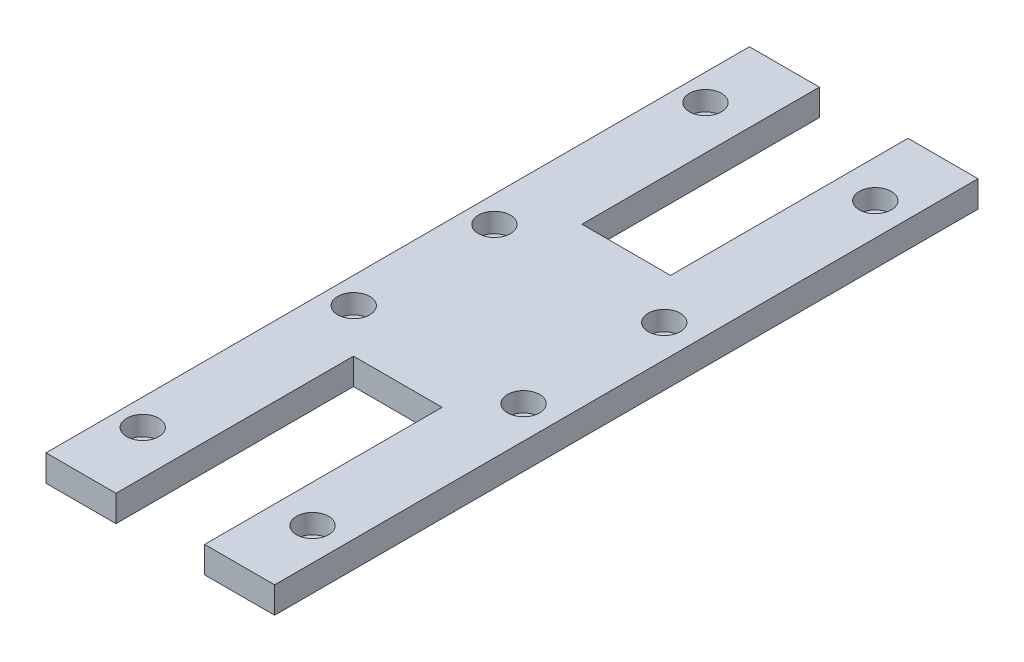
ISO-10303-21;
HEADER;
FILE_DESCRIPTION(('STEP AP214'),'2;1');
FILE_NAME('part.step','',(''),(''),'','','');
FILE_SCHEMA(('AUTOMOTIVE_DESIGN { 1 0 10303 214 1 1 1 1 }'));
ENDSEC;
DATA;
#1=APPLICATION_CONTEXT('core data for automotive mechanical design processes');
#2=APPLICATION_PROTOCOL_DEFINITION('international standard','automotive_design',2000,#1);
#3=PRODUCT_CONTEXT('',#1,'mechanical');
#4=PRODUCT('Part','Part','',(#3));
#5=PRODUCT_RELATED_PRODUCT_CATEGORY('part','',(#4));
#6=PRODUCT_DEFINITION_FORMATION('','',#4);
#7=PRODUCT_DEFINITION_CONTEXT('part definition',#1,'design');
#8=PRODUCT_DEFINITION('design','',#6,#7);
#9=PRODUCT_DEFINITION_SHAPE('','',#8);
#10=(LENGTH_UNIT() NAMED_UNIT(*) SI_UNIT(.MILLI.,.METRE.));
#11=(NAMED_UNIT(*) PLANE_ANGLE_UNIT() SI_UNIT($,.RADIAN.));
#12=(NAMED_UNIT(*) SI_UNIT($,.STERADIAN.) SOLID_ANGLE_UNIT());
#13=UNCERTAINTY_MEASURE_WITH_UNIT(LENGTH_MEASURE(1.E-05),#10,'distance_accuracy_value','');
#14=(GEOMETRIC_REPRESENTATION_CONTEXT(3) GLOBAL_UNCERTAINTY_ASSIGNED_CONTEXT((#13)) GLOBAL_UNIT_ASSIGNED_CONTEXT((#10,
#11,#12)) REPRESENTATION_CONTEXT('',''));
#15=CARTESIAN_POINT('',(0.,0.,0.));
#16=DIRECTION('',(0.,0.,1.));
#17=DIRECTION('',(1.,0.,0.));
#18=AXIS2_PLACEMENT_3D('',#15,#16,#17);
#19=CARTESIAN_POINT('',(35.4285027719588,-1.5875,-12.7));
#20=DIRECTION('',(0.,1.,0.));
#21=DIRECTION('',(0.,0.,1.));
#22=AXIS2_PLACEMENT_3D('',#19,#20,#21);
#23=CYLINDRICAL_SURFACE('',#22,1.778);
#24=CARTESIAN_POINT('',(35.4285027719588,0.,-12.7));
#25=DIRECTION('',(0.,-1.,0.));
#26=DIRECTION('',(0.,0.,-1.));
#27=AXIS2_PLACEMENT_3D('',#24,#25,#26);
#28=CIRCLE('',#27,1.778);
#29=CARTESIAN_POINT('',(35.4285027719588,0.,-14.478));
#30=VERTEX_POINT('',#29);
#31=EDGE_CURVE('E178',#30,#30,#28,.T.);
#32=ORIENTED_EDGE('',*,*,#31,.T.);
#33=EDGE_LOOP('',(#32));
#34=FACE_BOUND('',#33,.T.);
#35=CARTESIAN_POINT('',(35.4285027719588,1.2573,-12.7));
#36=DIRECTION('',(0.,1.,0.));
#37=DIRECTION('',(0.,0.,1.));
#38=AXIS2_PLACEMENT_3D('',#35,#36,#37);
#39=CIRCLE('',#38,1.778);
#40=CARTESIAN_POINT('',(35.4285027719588,1.2573,-10.922));
#41=VERTEX_POINT('',#40);
#42=EDGE_CURVE('E37',#41,#41,#39,.F.);
#43=ORIENTED_EDGE('',*,*,#42,.F.);
#44=EDGE_LOOP('',(#43));
#45=FACE_BOUND('',#44,.T.);
#46=ADVANCED_FACE('F33',(#34,#45),#23,.F.);
#47=CARTESIAN_POINT('',(35.4285027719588,-1.5875,-50.8));
#48=DIRECTION('',(0.,1.,0.));
#49=DIRECTION('',(0.,0.,1.));
#50=AXIS2_PLACEMENT_3D('',#47,#48,#49);
#51=CYLINDRICAL_SURFACE('',#50,1.778);
#52=CARTESIAN_POINT('',(35.4285027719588,0.,-50.8));
#53=DIRECTION('',(0.,-1.,0.));
#54=DIRECTION('',(0.,0.,-1.));
#55=AXIS2_PLACEMENT_3D('',#52,#53,#54);
#56=CIRCLE('',#55,1.778);
#57=CARTESIAN_POINT('',(35.4285027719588,0.,-52.578));
#58=VERTEX_POINT('',#57);
#59=EDGE_CURVE('E181',#58,#58,#56,.T.);
#60=ORIENTED_EDGE('',*,*,#59,.T.);
#61=EDGE_LOOP('',(#60));
#62=FACE_BOUND('',#61,.T.);
#63=CARTESIAN_POINT('',(35.4285027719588,1.2573,-50.8));
#64=DIRECTION('',(0.,1.,0.));
#65=DIRECTION('',(0.,0.,1.));
#66=AXIS2_PLACEMENT_3D('',#63,#64,#65);
#67=CIRCLE('',#66,1.778);
#68=CARTESIAN_POINT('',(35.4285027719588,1.2573,-49.022));
#69=VERTEX_POINT('',#68);
#70=EDGE_CURVE('E217',#69,#69,#67,.F.);
#71=ORIENTED_EDGE('',*,*,#70,.F.);
#72=EDGE_LOOP('',(#71));
#73=FACE_BOUND('',#72,.T.);
#74=ADVANCED_FACE('F303',(#62,#73),#51,.F.);
#75=CARTESIAN_POINT('',(35.4285027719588,-1.5875,-76.2));
#76=DIRECTION('',(0.,1.,0.));
#77=DIRECTION('',(0.,0.,1.));
#78=AXIS2_PLACEMENT_3D('',#75,#76,#77);
#79=CYLINDRICAL_SURFACE('',#78,1.778);
#80=CARTESIAN_POINT('',(35.4285027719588,0.,-76.2));
#81=DIRECTION('',(0.,-1.,0.));
#82=DIRECTION('',(0.,0.,-1.));
#83=AXIS2_PLACEMENT_3D('',#80,#81,#82);
#84=CIRCLE('',#83,1.778);
#85=CARTESIAN_POINT('',(35.4285027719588,0.,-77.978));
#86=VERTEX_POINT('',#85);
#87=EDGE_CURVE('E185',#86,#86,#84,.T.);
#88=ORIENTED_EDGE('',*,*,#87,.T.);
#89=EDGE_LOOP('',(#88));
#90=FACE_BOUND('',#89,.T.);
#91=CARTESIAN_POINT('',(35.4285027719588,1.2573,-76.2));
#92=DIRECTION('',(0.,1.,0.));
#93=DIRECTION('',(0.,0.,1.));
#94=AXIS2_PLACEMENT_3D('',#91,#92,#93);
#95=CIRCLE('',#94,1.778);
#96=CARTESIAN_POINT('',(35.4285027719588,1.2573,-74.422));
#97=VERTEX_POINT('',#96);
#98=EDGE_CURVE('E215',#97,#97,#95,.F.);
#99=ORIENTED_EDGE('',*,*,#98,.F.);
#100=EDGE_LOOP('',(#99));
#101=FACE_BOUND('',#100,.T.);
#102=ADVANCED_FACE('F309',(#90,#101),#79,.F.);
#103=CARTESIAN_POINT('',(35.4285027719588,-1.5875,-114.3));
#104=DIRECTION('',(0.,1.,0.));
#105=DIRECTION('',(0.,0.,1.));
#106=AXIS2_PLACEMENT_3D('',#103,#104,#105);
#107=CYLINDRICAL_SURFACE('',#106,1.778);
#108=CARTESIAN_POINT('',(35.4285027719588,0.,-114.3));
#109=DIRECTION('',(0.,-1.,0.));
#110=DIRECTION('',(0.,0.,-1.));
#111=AXIS2_PLACEMENT_3D('',#108,#109,#110);
#112=CIRCLE('',#111,1.778);
#113=CARTESIAN_POINT('',(35.4285027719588,0.,-116.078));
#114=VERTEX_POINT('',#113);
#115=EDGE_CURVE('E188',#114,#114,#112,.T.);
#116=ORIENTED_EDGE('',*,*,#115,.T.);
#117=EDGE_LOOP('',(#116));
#118=FACE_BOUND('',#117,.T.);
#119=CARTESIAN_POINT('',(35.4285027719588,1.2573,-114.3));
#120=DIRECTION('',(0.,1.,0.));
#121=DIRECTION('',(0.,0.,1.));
#122=AXIS2_PLACEMENT_3D('',#119,#120,#121);
#123=CIRCLE('',#122,1.778);
#124=CARTESIAN_POINT('',(35.4285027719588,1.2573,-112.522));
#125=VERTEX_POINT('',#124);
#126=EDGE_CURVE('E212',#125,#125,#123,.F.);
#127=ORIENTED_EDGE('',*,*,#126,.F.);
#128=EDGE_LOOP('',(#127));
#129=FACE_BOUND('',#128,.T.);
#130=ADVANCED_FACE('F351',(#118,#129),#107,.F.);
#131=CARTESIAN_POINT('',(4.7625,-1.5875,-12.7));
#132=DIRECTION('',(0.,1.,0.));
#133=DIRECTION('',(0.,0.,1.));
#134=AXIS2_PLACEMENT_3D('',#131,#132,#133);
#135=CYLINDRICAL_SURFACE('',#134,1.778);
#136=CARTESIAN_POINT('',(4.7625,0.,-12.7));
#137=DIRECTION('',(0.,-1.,0.));
#138=DIRECTION('',(0.,0.,-1.));
#139=AXIS2_PLACEMENT_3D('',#136,#137,#138);
#140=CIRCLE('',#139,1.778);
#141=CARTESIAN_POINT('',(4.7625,0.,-14.478));
#142=VERTEX_POINT('',#141);
#143=EDGE_CURVE('E191',#142,#142,#140,.T.);
#144=ORIENTED_EDGE('',*,*,#143,.T.);
#145=EDGE_LOOP('',(#144));
#146=FACE_BOUND('',#145,.T.);
#147=CARTESIAN_POINT('',(4.7625,1.2573,-12.7));
#148=DIRECTION('',(0.,1.,0.));
#149=DIRECTION('',(0.,0.,1.));
#150=AXIS2_PLACEMENT_3D('',#147,#148,#149);
#151=CIRCLE('',#150,1.778);
#152=CARTESIAN_POINT('',(4.7625,1.2573,-10.922));
#153=VERTEX_POINT('',#152);
#154=EDGE_CURVE('E209',#153,#153,#151,.F.);
#155=ORIENTED_EDGE('',*,*,#154,.F.);
#156=EDGE_LOOP('',(#155));
#157=FACE_BOUND('',#156,.T.);
#158=ADVANCED_FACE('F347',(#146,#157),#135,.F.);
#159=CARTESIAN_POINT('',(4.7625,-1.5875,-50.8));
#160=DIRECTION('',(0.,1.,0.));
#161=DIRECTION('',(0.,0.,1.));
#162=AXIS2_PLACEMENT_3D('',#159,#160,#161);
#163=CYLINDRICAL_SURFACE('',#162,1.778);
#164=CARTESIAN_POINT('',(4.7625,0.,-50.8));
#165=DIRECTION('',(0.,-1.,0.));
#166=DIRECTION('',(0.,0.,-1.));
#167=AXIS2_PLACEMENT_3D('',#164,#165,#166);
#168=CIRCLE('',#167,1.778);
#169=CARTESIAN_POINT('',(4.7625,0.,-52.578));
#170=VERTEX_POINT('',#169);
#171=EDGE_CURVE('E194',#170,#170,#168,.T.);
#172=ORIENTED_EDGE('',*,*,#171,.T.);
#173=EDGE_LOOP('',(#172));
#174=FACE_BOUND('',#173,.T.);
#175=CARTESIAN_POINT('',(4.7625,1.2573,-50.8));
#176=DIRECTION('',(0.,1.,0.));
#177=DIRECTION('',(0.,0.,1.));
#178=AXIS2_PLACEMENT_3D('',#175,#176,#177);
#179=CIRCLE('',#178,1.778);
#180=CARTESIAN_POINT('',(4.7625,1.2573,-49.022));
#181=VERTEX_POINT('',#180);
#182=EDGE_CURVE('E205',#181,#181,#179,.F.);
#183=ORIENTED_EDGE('',*,*,#182,.F.);
#184=EDGE_LOOP('',(#183));
#185=FACE_BOUND('',#184,.T.);
#186=ADVANCED_FACE('F324',(#174,#185),#163,.F.);
#187=CARTESIAN_POINT('',(4.7625,-1.5875,-76.2));
#188=DIRECTION('',(0.,1.,0.));
#189=DIRECTION('',(0.,0.,1.));
#190=AXIS2_PLACEMENT_3D('',#187,#188,#189);
#191=CYLINDRICAL_SURFACE('',#190,1.778);
#192=CARTESIAN_POINT('',(4.7625,0.,-76.2));
#193=DIRECTION('',(0.,-1.,0.));
#194=DIRECTION('',(0.,0.,-1.));
#195=AXIS2_PLACEMENT_3D('',#192,#193,#194);
#196=CIRCLE('',#195,1.778);
#197=CARTESIAN_POINT('',(4.7625,0.,-77.978));
#198=VERTEX_POINT('',#197);
#199=EDGE_CURVE('E177',#198,#198,#196,.T.);
#200=ORIENTED_EDGE('',*,*,#199,.T.);
#201=EDGE_LOOP('',(#200));
#202=FACE_BOUND('',#201,.T.);
#203=CARTESIAN_POINT('',(4.7625,1.2573,-76.2));
#204=DIRECTION('',(0.,1.,0.));
#205=DIRECTION('',(0.,0.,1.));
#206=AXIS2_PLACEMENT_3D('',#203,#204,#205);
#207=CIRCLE('',#206,1.778);
#208=CARTESIAN_POINT('',(4.7625,1.2573,-74.422));
#209=VERTEX_POINT('',#208);
#210=EDGE_CURVE('E202',#209,#209,#207,.F.);
#211=ORIENTED_EDGE('',*,*,#210,.F.);
#212=EDGE_LOOP('',(#211));
#213=FACE_BOUND('',#212,.T.);
#214=ADVANCED_FACE('F316',(#202,#213),#191,.F.);
#215=CARTESIAN_POINT('',(4.7625,-1.5875,-114.3));
#216=DIRECTION('',(0.,1.,0.));
#217=DIRECTION('',(0.,0.,1.));
#218=AXIS2_PLACEMENT_3D('',#215,#216,#217);
#219=CYLINDRICAL_SURFACE('',#218,1.778);
#220=CARTESIAN_POINT('',(4.7625,0.,-114.3));
#221=DIRECTION('',(0.,-1.,0.));
#222=DIRECTION('',(0.,0.,-1.));
#223=AXIS2_PLACEMENT_3D('',#220,#221,#222);
#224=CIRCLE('',#223,1.778);
#225=CARTESIAN_POINT('',(4.7625,0.,-116.078));
#226=VERTEX_POINT('',#225);
#227=EDGE_CURVE('E134',#226,#226,#224,.T.);
#228=ORIENTED_EDGE('',*,*,#227,.T.);
#229=EDGE_LOOP('',(#228));
#230=FACE_BOUND('',#229,.T.);
#231=CARTESIAN_POINT('',(4.7625,1.2573,-114.3));
#232=DIRECTION('',(0.,1.,0.));
#233=DIRECTION('',(0.,0.,1.));
#234=AXIS2_PLACEMENT_3D('',#231,#232,#233);
#235=CIRCLE('',#234,1.778);
#236=CARTESIAN_POINT('',(4.7625,1.2573,-112.522));
#237=VERTEX_POINT('',#236);
#238=EDGE_CURVE('E182',#237,#237,#235,.F.);
#239=ORIENTED_EDGE('',*,*,#238,.F.);
#240=EDGE_LOOP('',(#239));
#241=FACE_BOUND('',#240,.T.);
#242=ADVANCED_FACE('F314',(#230,#241),#219,.F.);
#243=CARTESIAN_POINT('',(0.,0.,0.));
#244=DIRECTION('',(0.,0.,-1.));
#245=DIRECTION('',(-1.,0.,0.));
#246=AXIS2_PLACEMENT_3D('',#243,#244,#245);
#247=PLANE('',#246);
#248=DIRECTION('',(1.,0.,0.));
#249=VECTOR('',#248,1.);
#250=CARTESIAN_POINT('',(0.,0.,0.));
#251=LINE('',#250,#249);
#252=CARTESIAN_POINT('',(0.,0.,0.));
#253=VERTEX_POINT('',#252);
#254=CARTESIAN_POINT('',(12.6365,0.,0.));
#255=VERTEX_POINT('',#254);
#256=EDGE_CURVE('E143',#253,#255,#251,.T.);
#257=ORIENTED_EDGE('',*,*,#256,.T.);
#258=DIRECTION('',(0.,1.,0.));
#259=VECTOR('',#258,1.);
#260=CARTESIAN_POINT('',(12.6365,0.,0.));
#261=LINE('',#260,#259);
#262=CARTESIAN_POINT('',(12.6365,4.7625,0.));
#263=VERTEX_POINT('',#262);
#264=EDGE_CURVE('E42',#255,#263,#261,.T.);
#265=ORIENTED_EDGE('',*,*,#264,.T.);
#266=DIRECTION('',(-1.,0.,0.));
#267=VECTOR('',#266,1.);
#268=CARTESIAN_POINT('',(0.,4.7625,0.));
#269=LINE('',#268,#267);
#270=CARTESIAN_POINT('',(0.,4.7625,0.));
#271=VERTEX_POINT('',#270);
#272=EDGE_CURVE('E140',#263,#271,#269,.T.);
#273=ORIENTED_EDGE('',*,*,#272,.T.);
#274=DIRECTION('',(0.,-1.,0.));
#275=VECTOR('',#274,1.);
#276=CARTESIAN_POINT('',(0.,0.,0.));
#277=LINE('',#276,#275);
#278=EDGE_CURVE('E258',#271,#253,#277,.T.);
#279=ORIENTED_EDGE('',*,*,#278,.T.);
#280=EDGE_LOOP('',(#257,#265,#273,#279));
#281=FACE_BOUND('',#280,.T.);
#282=ADVANCED_FACE('F138',(#281),#247,.F.);
#283=CARTESIAN_POINT('',(0.,0.,-127.));
#284=DIRECTION('',(0.,0.,-1.));
#285=DIRECTION('',(-1.,0.,0.));
#286=AXIS2_PLACEMENT_3D('',#283,#284,#285);
#287=PLANE('',#286);
#288=DIRECTION('',(0.,1.,0.));
#289=VECTOR('',#288,1.);
#290=CARTESIAN_POINT('',(12.6365,0.,-127.));
#291=LINE('',#290,#289);
#292=CARTESIAN_POINT('',(12.6365,0.,-127.));
#293=VERTEX_POINT('',#292);
#294=CARTESIAN_POINT('',(12.6365,4.7625,-127.));
#295=VERTEX_POINT('',#294);
#296=EDGE_CURVE('E170',#293,#295,#291,.T.);
#297=ORIENTED_EDGE('',*,*,#296,.F.);
#298=DIRECTION('',(1.,0.,0.));
#299=VECTOR('',#298,1.);
#300=CARTESIAN_POINT('',(0.,0.,-127.));
#301=LINE('',#300,#299);
#302=CARTESIAN_POINT('',(0.,0.,-127.));
#303=VERTEX_POINT('',#302);
#304=EDGE_CURVE('E262',#303,#293,#301,.T.);
#305=ORIENTED_EDGE('',*,*,#304,.F.);
#306=DIRECTION('',(0.,-1.,0.));
#307=VECTOR('',#306,1.);
#308=CARTESIAN_POINT('',(0.,0.,-127.));
#309=LINE('',#308,#307);
#310=CARTESIAN_POINT('',(0.,4.7625,-127.));
#311=VERTEX_POINT('',#310);
#312=EDGE_CURVE('E154',#311,#303,#309,.T.);
#313=ORIENTED_EDGE('',*,*,#312,.F.);
#314=DIRECTION('',(-1.,0.,0.));
#315=VECTOR('',#314,1.);
#316=CARTESIAN_POINT('',(0.,4.7625,-127.));
#317=LINE('',#316,#315);
#318=EDGE_CURVE('E268',#295,#311,#317,.T.);
#319=ORIENTED_EDGE('',*,*,#318,.F.);
#320=EDGE_LOOP('',(#297,#305,#313,#319));
#321=FACE_BOUND('',#320,.T.);
#322=ADVANCED_FACE('F322',(#321),#287,.T.);
#323=CARTESIAN_POINT('',(0.,0.,-127.));
#324=DIRECTION('',(-1.,0.,0.));
#325=DIRECTION('',(0.,0.,1.));
#326=AXIS2_PLACEMENT_3D('',#323,#324,#325);
#327=PLANE('',#326);
#328=ORIENTED_EDGE('',*,*,#278,.F.);
#329=DIRECTION('',(0.,0.,1.));
#330=VECTOR('',#329,1.);
#331=CARTESIAN_POINT('',(0.,4.7625,-127.));
#332=LINE('',#331,#330);
#333=EDGE_CURVE('E148',#311,#271,#332,.T.);
#334=ORIENTED_EDGE('',*,*,#333,.F.);
#335=ORIENTED_EDGE('',*,*,#312,.T.);
#336=DIRECTION('',(0.,0.,1.));
#337=VECTOR('',#336,1.);
#338=CARTESIAN_POINT('',(0.,0.,-127.));
#339=LINE('',#338,#337);
#340=EDGE_CURVE('E166',#303,#253,#339,.T.);
#341=ORIENTED_EDGE('',*,*,#340,.T.);
#342=EDGE_LOOP('',(#328,#334,#335,#341));
#343=FACE_BOUND('',#342,.T.);
#344=ADVANCED_FACE('F35',(#343),#327,.T.);
#345=CARTESIAN_POINT('',(0.,4.7625,-127.));
#346=DIRECTION('',(0.,1.,0.));
#347=DIRECTION('',(0.,0.,1.));
#348=AXIS2_PLACEMENT_3D('',#345,#346,#347);
#349=PLANE('',#348);
#350=CARTESIAN_POINT('',(4.7625,4.7625,-76.2));
#351=DIRECTION('',(0.,1.,0.));
#352=DIRECTION('',(0.,0.,1.));
#353=AXIS2_PLACEMENT_3D('',#350,#351,#352);
#354=CIRCLE('',#353,2.8956);
#355=CARTESIAN_POINT('',(4.7625,4.7625,-73.3044));
#356=VERTEX_POINT('',#355);
#357=EDGE_CURVE('E429',#356,#356,#354,.T.);
#358=ORIENTED_EDGE('',*,*,#357,.F.);
#359=EDGE_LOOP('',(#358));
#360=FACE_BOUND('',#359,.T.);
#361=CARTESIAN_POINT('',(4.7625,4.7625,-50.8));
#362=DIRECTION('',(0.,1.,0.));
#363=DIRECTION('',(0.,0.,1.));
#364=AXIS2_PLACEMENT_3D('',#361,#362,#363);
#365=CIRCLE('',#364,2.8956);
#366=CARTESIAN_POINT('',(4.7625,4.7625,-47.9044));
#367=VERTEX_POINT('',#366);
#368=EDGE_CURVE('E423',#367,#367,#365,.T.);
#369=ORIENTED_EDGE('',*,*,#368,.F.);
#370=EDGE_LOOP('',(#369));
#371=FACE_BOUND('',#370,.T.);
#372=CARTESIAN_POINT('',(4.7625,4.7625,-12.7));
#373=DIRECTION('',(0.,1.,0.));
#374=DIRECTION('',(0.,0.,1.));
#375=AXIS2_PLACEMENT_3D('',#372,#373,#374);
#376=CIRCLE('',#375,2.8956);
#377=CARTESIAN_POINT('',(4.7625,4.7625,-9.80439999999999));
#378=VERTEX_POINT('',#377);
#379=EDGE_CURVE('E417',#378,#378,#376,.T.);
#380=ORIENTED_EDGE('',*,*,#379,.F.);
#381=EDGE_LOOP('',(#380));
#382=FACE_BOUND('',#381,.T.);
#383=CARTESIAN_POINT('',(35.4285027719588,4.7625,-12.7));
#384=DIRECTION('',(0.,1.,0.));
#385=DIRECTION('',(0.,0.,1.));
#386=AXIS2_PLACEMENT_3D('',#383,#384,#385);
#387=CIRCLE('',#386,2.8956);
#388=CARTESIAN_POINT('',(35.4285027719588,4.7625,-9.80439999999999));
#389=VERTEX_POINT('',#388);
#390=EDGE_CURVE('E411',#389,#389,#387,.T.);
#391=ORIENTED_EDGE('',*,*,#390,.F.);
#392=EDGE_LOOP('',(#391));
#393=FACE_BOUND('',#392,.T.);
#394=CARTESIAN_POINT('',(35.4285027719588,4.7625,-50.8));
#395=DIRECTION('',(0.,1.,0.));
#396=DIRECTION('',(0.,0.,1.));
#397=AXIS2_PLACEMENT_3D('',#394,#395,#396);
#398=CIRCLE('',#397,2.8956);
#399=CARTESIAN_POINT('',(35.4285027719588,4.7625,-47.9044));
#400=VERTEX_POINT('',#399);
#401=EDGE_CURVE('E405',#400,#400,#398,.T.);
#402=ORIENTED_EDGE('',*,*,#401,.F.);
#403=EDGE_LOOP('',(#402));
#404=FACE_BOUND('',#403,.T.);
#405=CARTESIAN_POINT('',(35.4285027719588,4.7625,-76.2));
#406=DIRECTION('',(0.,1.,0.));
#407=DIRECTION('',(0.,0.,1.));
#408=AXIS2_PLACEMENT_3D('',#405,#406,#407);
#409=CIRCLE('',#408,2.8956);
#410=CARTESIAN_POINT('',(35.4285027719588,4.7625,-73.3044));
#411=VERTEX_POINT('',#410);
#412=EDGE_CURVE('E396',#411,#411,#409,.T.);
#413=ORIENTED_EDGE('',*,*,#412,.F.);
#414=EDGE_LOOP('',(#413));
#415=FACE_BOUND('',#414,.T.);
#416=CARTESIAN_POINT('',(35.4285027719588,4.7625,-114.3));
#417=DIRECTION('',(0.,1.,0.));
#418=DIRECTION('',(0.,0.,1.));
#419=AXIS2_PLACEMENT_3D('',#416,#417,#418);
#420=CIRCLE('',#419,2.8956);
#421=CARTESIAN_POINT('',(35.4285027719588,4.7625,-111.4044));
#422=VERTEX_POINT('',#421);
#423=EDGE_CURVE('E397',#422,#422,#420,.T.);
#424=ORIENTED_EDGE('',*,*,#423,.F.);
#425=EDGE_LOOP('',(#424));
#426=FACE_BOUND('',#425,.T.);
#427=CARTESIAN_POINT('',(4.7625,4.7625,-114.3));
#428=DIRECTION('',(0.,1.,0.));
#429=DIRECTION('',(0.,0.,1.));
#430=AXIS2_PLACEMENT_3D('',#427,#428,#429);
#431=CIRCLE('',#430,2.8956);
#432=CARTESIAN_POINT('',(4.7625,4.7625,-111.4044));
#433=VERTEX_POINT('',#432);
#434=EDGE_CURVE('E222',#433,#433,#431,.T.);
#435=ORIENTED_EDGE('',*,*,#434,.F.);
#436=EDGE_LOOP('',(#435));
#437=FACE_BOUND('',#436,.T.);
#438=DIRECTION('',(0.,0.,1.));
#439=VECTOR('',#438,1.);
#440=CARTESIAN_POINT('',(12.6365,4.7625,0.));
#441=LINE('',#440,#439);
#442=CARTESIAN_POINT('',(12.6365,4.7625,-42.8752));
#443=VERTEX_POINT('',#442);
#444=EDGE_CURVE('E123',#443,#263,#441,.T.);
#445=ORIENTED_EDGE('',*,*,#444,.F.);
#446=DIRECTION('',(-1.,0.,0.));
#447=VECTOR('',#446,1.);
#448=CARTESIAN_POINT('',(12.6365,4.7625,-42.8752));
#449=LINE('',#448,#447);
#450=CARTESIAN_POINT('',(28.6385,4.7625,-42.8752));
#451=VERTEX_POINT('',#450);
#452=EDGE_CURVE('E235',#451,#443,#449,.T.);
#453=ORIENTED_EDGE('',*,*,#452,.F.);
#454=DIRECTION('',(0.,0.,-1.));
#455=VECTOR('',#454,1.);
#456=CARTESIAN_POINT('',(28.6385,4.7625,0.));
#457=LINE('',#456,#455);
#458=CARTESIAN_POINT('',(28.6385,4.7625,0.));
#459=VERTEX_POINT('',#458);
#460=EDGE_CURVE('E133',#459,#451,#457,.T.);
#461=ORIENTED_EDGE('',*,*,#460,.F.);
#462=CARTESIAN_POINT('',(41.275,4.7625,0.));
#463=VERTEX_POINT('',#462);
#464=EDGE_CURVE('E150',#463,#459,#269,.T.);
#465=ORIENTED_EDGE('',*,*,#464,.F.);
#466=DIRECTION('',(0.,0.,1.));
#467=VECTOR('',#466,1.);
#468=CARTESIAN_POINT('',(41.275,4.7625,-127.));
#469=LINE('',#468,#467);
#470=CARTESIAN_POINT('',(41.275,4.7625,-127.));
#471=VERTEX_POINT('',#470);
#472=EDGE_CURVE('E161',#471,#463,#469,.T.);
#473=ORIENTED_EDGE('',*,*,#472,.F.);
#474=CARTESIAN_POINT('',(28.6385,4.7625,-127.));
#475=VERTEX_POINT('',#474);
#476=EDGE_CURVE('E168',#471,#475,#317,.T.);
#477=ORIENTED_EDGE('',*,*,#476,.T.);
#478=DIRECTION('',(0.,0.,-1.));
#479=VECTOR('',#478,1.);
#480=CARTESIAN_POINT('',(28.6385,4.7625,-127.));
#481=LINE('',#480,#479);
#482=CARTESIAN_POINT('',(28.6385,4.7625,-84.1248));
#483=VERTEX_POINT('',#482);
#484=EDGE_CURVE('E58',#483,#475,#481,.T.);
#485=ORIENTED_EDGE('',*,*,#484,.F.);
#486=DIRECTION('',(1.,0.,0.));
#487=VECTOR('',#486,1.);
#488=CARTESIAN_POINT('',(12.6365,4.7625,-84.1248));
#489=LINE('',#488,#487);
#490=CARTESIAN_POINT('',(12.6365,4.7625,-84.1248));
#491=VERTEX_POINT('',#490);
#492=EDGE_CURVE('E246',#491,#483,#489,.T.);
#493=ORIENTED_EDGE('',*,*,#492,.F.);
#494=DIRECTION('',(0.,0.,1.));
#495=VECTOR('',#494,1.);
#496=CARTESIAN_POINT('',(12.6365,4.7625,-127.));
#497=LINE('',#496,#495);
#498=EDGE_CURVE('E243',#295,#491,#497,.T.);
#499=ORIENTED_EDGE('',*,*,#498,.F.);
#500=ORIENTED_EDGE('',*,*,#318,.T.);
#501=ORIENTED_EDGE('',*,*,#333,.T.);
#502=ORIENTED_EDGE('',*,*,#272,.F.);
#503=EDGE_LOOP('',(#445,#453,#461,#465,#473,#477,#485,#493,#499,#500,#501,#502));
#504=FACE_BOUND('',#503,.T.);
#505=ADVANCED_FACE('F146',(#360,#371,#382,#393,#404,#415,#426,#437,#504),#349,.T.);
#506=CARTESIAN_POINT('',(41.275,0.,-127.));
#507=DIRECTION('',(1.,0.,0.));
#508=DIRECTION('',(0.,0.,-1.));
#509=AXIS2_PLACEMENT_3D('',#506,#507,#508);
#510=PLANE('',#509);
#511=DIRECTION('',(0.,1.,0.));
#512=VECTOR('',#511,1.);
#513=CARTESIAN_POINT('',(41.275,0.,0.));
#514=LINE('',#513,#512);
#515=CARTESIAN_POINT('',(41.275,0.,0.));
#516=VERTEX_POINT('',#515);
#517=EDGE_CURVE('E151',#516,#463,#514,.T.);
#518=ORIENTED_EDGE('',*,*,#517,.F.);
#519=DIRECTION('',(0.,0.,1.));
#520=VECTOR('',#519,1.);
#521=CARTESIAN_POINT('',(41.275,0.,-127.));
#522=LINE('',#521,#520);
#523=CARTESIAN_POINT('',(41.275,0.,-127.));
#524=VERTEX_POINT('',#523);
#525=EDGE_CURVE('E163',#524,#516,#522,.T.);
#526=ORIENTED_EDGE('',*,*,#525,.F.);
#527=DIRECTION('',(0.,1.,0.));
#528=VECTOR('',#527,1.);
#529=CARTESIAN_POINT('',(41.275,0.,-127.));
#530=LINE('',#529,#528);
#531=EDGE_CURVE('E265',#524,#471,#530,.T.);
#532=ORIENTED_EDGE('',*,*,#531,.T.);
#533=ORIENTED_EDGE('',*,*,#472,.T.);
#534=EDGE_LOOP('',(#518,#526,#532,#533));
#535=FACE_BOUND('',#534,.T.);
#536=ADVANCED_FACE('F284',(#535),#510,.T.);
#537=CARTESIAN_POINT('',(0.,0.,-127.));
#538=DIRECTION('',(0.,-1.,0.));
#539=DIRECTION('',(0.,0.,-1.));
#540=AXIS2_PLACEMENT_3D('',#537,#538,#539);
#541=PLANE('',#540);
#542=ORIENTED_EDGE('',*,*,#199,.F.);
#543=EDGE_LOOP('',(#542));
#544=FACE_BOUND('',#543,.T.);
#545=ORIENTED_EDGE('',*,*,#171,.F.);
#546=EDGE_LOOP('',(#545));
#547=FACE_BOUND('',#546,.T.);
#548=ORIENTED_EDGE('',*,*,#143,.F.);
#549=EDGE_LOOP('',(#548));
#550=FACE_BOUND('',#549,.T.);
#551=ORIENTED_EDGE('',*,*,#115,.F.);
#552=EDGE_LOOP('',(#551));
#553=FACE_BOUND('',#552,.T.);
#554=ORIENTED_EDGE('',*,*,#87,.F.);
#555=EDGE_LOOP('',(#554));
#556=FACE_BOUND('',#555,.T.);
#557=ORIENTED_EDGE('',*,*,#59,.F.);
#558=EDGE_LOOP('',(#557));
#559=FACE_BOUND('',#558,.T.);
#560=ORIENTED_EDGE('',*,*,#31,.F.);
#561=EDGE_LOOP('',(#560));
#562=FACE_BOUND('',#561,.T.);
#563=ORIENTED_EDGE('',*,*,#227,.F.);
#564=EDGE_LOOP('',(#563));
#565=FACE_BOUND('',#564,.T.);
#566=DIRECTION('',(0.,0.,-1.));
#567=VECTOR('',#566,1.);
#568=CARTESIAN_POINT('',(12.6365,0.,-127.));
#569=LINE('',#568,#567);
#570=CARTESIAN_POINT('',(12.6365,0.,-42.8752));
#571=VERTEX_POINT('',#570);
#572=EDGE_CURVE('E241',#255,#571,#569,.T.);
#573=ORIENTED_EDGE('',*,*,#572,.F.);
#574=ORIENTED_EDGE('',*,*,#256,.F.);
#575=ORIENTED_EDGE('',*,*,#340,.F.);
#576=ORIENTED_EDGE('',*,*,#304,.T.);
#577=DIRECTION('',(0.,0.,-1.));
#578=VECTOR('',#577,1.);
#579=CARTESIAN_POINT('',(12.6365,0.,-127.));
#580=LINE('',#579,#578);
#581=CARTESIAN_POINT('',(12.6365,0.,-84.1248));
#582=VERTEX_POINT('',#581);
#583=EDGE_CURVE('E256',#582,#293,#580,.T.);
#584=ORIENTED_EDGE('',*,*,#583,.F.);
#585=DIRECTION('',(-1.,0.,0.));
#586=VECTOR('',#585,1.);
#587=CARTESIAN_POINT('',(0.,0.,-84.1248));
#588=LINE('',#587,#586);
#589=CARTESIAN_POINT('',(28.6385,0.,-84.1248));
#590=VERTEX_POINT('',#589);
#591=EDGE_CURVE('E172',#590,#582,#588,.T.);
#592=ORIENTED_EDGE('',*,*,#591,.F.);
#593=DIRECTION('',(0.,0.,1.));
#594=VECTOR('',#593,1.);
#595=CARTESIAN_POINT('',(28.6385,0.,-127.));
#596=LINE('',#595,#594);
#597=CARTESIAN_POINT('',(28.6385,0.,-127.));
#598=VERTEX_POINT('',#597);
#599=EDGE_CURVE('E253',#598,#590,#596,.T.);
#600=ORIENTED_EDGE('',*,*,#599,.F.);
#601=EDGE_CURVE('E261',#598,#524,#301,.T.);
#602=ORIENTED_EDGE('',*,*,#601,.T.);
#603=ORIENTED_EDGE('',*,*,#525,.T.);
#604=CARTESIAN_POINT('',(28.6385,0.,0.));
#605=VERTEX_POINT('',#604);
#606=EDGE_CURVE('E271',#605,#516,#251,.T.);
#607=ORIENTED_EDGE('',*,*,#606,.F.);
#608=DIRECTION('',(0.,0.,1.));
#609=VECTOR('',#608,1.);
#610=CARTESIAN_POINT('',(28.6385,0.,-127.));
#611=LINE('',#610,#609);
#612=CARTESIAN_POINT('',(28.6385,0.,-42.8752));
#613=VERTEX_POINT('',#612);
#614=EDGE_CURVE('E50',#613,#605,#611,.T.);
#615=ORIENTED_EDGE('',*,*,#614,.F.);
#616=DIRECTION('',(1.,0.,0.));
#617=VECTOR('',#616,1.);
#618=CARTESIAN_POINT('',(0.,0.,-42.8752));
#619=LINE('',#618,#617);
#620=EDGE_CURVE('E11',#571,#613,#619,.T.);
#621=ORIENTED_EDGE('',*,*,#620,.F.);
#622=EDGE_LOOP('',(#573,#574,#575,#576,#584,#592,#600,#602,#603,#607,#615,#621));
#623=FACE_BOUND('',#622,.T.);
#624=ADVANCED_FACE('F279',(#544,#547,#550,#553,#556,#559,#562,#565,#623),#541,.T.);
#625=DIRECTION('',(0.,-1.,0.));
#626=VECTOR('',#625,1.);
#627=CARTESIAN_POINT('',(28.6385,0.,-127.));
#628=LINE('',#627,#626);
#629=EDGE_CURVE('E160',#475,#598,#628,.T.);
#630=ORIENTED_EDGE('',*,*,#629,.F.);
#631=ORIENTED_EDGE('',*,*,#476,.F.);
#632=ORIENTED_EDGE('',*,*,#531,.F.);
#633=ORIENTED_EDGE('',*,*,#601,.F.);
#634=EDGE_LOOP('',(#630,#631,#632,#633));
#635=FACE_BOUND('',#634,.T.);
#636=ADVANCED_FACE('F670',(#635),#287,.T.);
#637=ORIENTED_EDGE('',*,*,#464,.T.);
#638=DIRECTION('',(0.,-1.,0.));
#639=VECTOR('',#638,1.);
#640=CARTESIAN_POINT('',(28.6385,0.,0.));
#641=LINE('',#640,#639);
#642=EDGE_CURVE('E144',#459,#605,#641,.T.);
#643=ORIENTED_EDGE('',*,*,#642,.T.);
#644=ORIENTED_EDGE('',*,*,#606,.T.);
#645=ORIENTED_EDGE('',*,*,#517,.T.);
#646=EDGE_LOOP('',(#637,#643,#644,#645));
#647=FACE_BOUND('',#646,.T.);
#648=ADVANCED_FACE('F274',(#647),#247,.F.);
#649=CARTESIAN_POINT('',(12.6365,-122.2375,-127.));
#650=DIRECTION('',(-1.,0.,0.));
#651=DIRECTION('',(0.,0.,1.));
#652=AXIS2_PLACEMENT_3D('',#649,#650,#651);
#653=PLANE('',#652);
#654=ORIENTED_EDGE('',*,*,#583,.T.);
#655=ORIENTED_EDGE('',*,*,#296,.T.);
#656=ORIENTED_EDGE('',*,*,#498,.T.);
#657=DIRECTION('',(0.,1.,0.));
#658=VECTOR('',#657,1.);
#659=CARTESIAN_POINT('',(12.6365,-122.2375,-84.1248));
#660=LINE('',#659,#658);
#661=EDGE_CURVE('E250',#582,#491,#660,.T.);
#662=ORIENTED_EDGE('',*,*,#661,.F.);
#663=EDGE_LOOP('',(#654,#655,#656,#662));
#664=FACE_BOUND('',#663,.T.);
#665=ADVANCED_FACE('F645',(#664),#653,.F.);
#666=CARTESIAN_POINT('',(28.6385,-122.2375,-127.));
#667=DIRECTION('',(1.,0.,0.));
#668=DIRECTION('',(0.,0.,-1.));
#669=AXIS2_PLACEMENT_3D('',#666,#667,#668);
#670=PLANE('',#669);
#671=ORIENTED_EDGE('',*,*,#599,.T.);
#672=DIRECTION('',(0.,1.,0.));
#673=VECTOR('',#672,1.);
#674=CARTESIAN_POINT('',(28.6385,-122.2375,-84.1248));
#675=LINE('',#674,#673);
#676=EDGE_CURVE('E251',#590,#483,#675,.T.);
#677=ORIENTED_EDGE('',*,*,#676,.T.);
#678=ORIENTED_EDGE('',*,*,#484,.T.);
#679=ORIENTED_EDGE('',*,*,#629,.T.);
#680=EDGE_LOOP('',(#671,#677,#678,#679));
#681=FACE_BOUND('',#680,.T.);
#682=ADVANCED_FACE('F636',(#681),#670,.F.);
#683=CARTESIAN_POINT('',(12.6365,-122.2375,-84.1248));
#684=DIRECTION('',(0.,0.,1.));
#685=DIRECTION('',(1.,0.,0.));
#686=AXIS2_PLACEMENT_3D('',#683,#684,#685);
#687=PLANE('',#686);
#688=ORIENTED_EDGE('',*,*,#591,.T.);
#689=ORIENTED_EDGE('',*,*,#661,.T.);
#690=ORIENTED_EDGE('',*,*,#492,.T.);
#691=ORIENTED_EDGE('',*,*,#676,.F.);
#692=EDGE_LOOP('',(#688,#689,#690,#691));
#693=FACE_BOUND('',#692,.T.);
#694=ADVANCED_FACE('F299',(#693),#687,.F.);
#695=CARTESIAN_POINT('',(12.6365,-122.2375,0.));
#696=DIRECTION('',(-1.,0.,0.));
#697=DIRECTION('',(0.,0.,1.));
#698=AXIS2_PLACEMENT_3D('',#695,#696,#697);
#699=PLANE('',#698);
#700=ORIENTED_EDGE('',*,*,#572,.T.);
#701=DIRECTION('',(0.,1.,0.));
#702=VECTOR('',#701,1.);
#703=CARTESIAN_POINT('',(12.6365,-122.2375,-42.8752));
#704=LINE('',#703,#702);
#705=EDGE_CURVE('E128',#571,#443,#704,.T.);
#706=ORIENTED_EDGE('',*,*,#705,.T.);
#707=ORIENTED_EDGE('',*,*,#444,.T.);
#708=ORIENTED_EDGE('',*,*,#264,.F.);
#709=EDGE_LOOP('',(#700,#706,#707,#708));
#710=FACE_BOUND('',#709,.T.);
#711=ADVANCED_FACE('F125',(#710),#699,.F.);
#712=CARTESIAN_POINT('',(12.6365,-122.2375,-42.8752));
#713=DIRECTION('',(0.,0.,-1.));
#714=DIRECTION('',(-1.,0.,0.));
#715=AXIS2_PLACEMENT_3D('',#712,#713,#714);
#716=PLANE('',#715);
#717=ORIENTED_EDGE('',*,*,#620,.T.);
#718=DIRECTION('',(0.,1.,0.));
#719=VECTOR('',#718,1.);
#720=CARTESIAN_POINT('',(28.6385,-122.2375,-42.8752));
#721=LINE('',#720,#719);
#722=EDGE_CURVE('E237',#613,#451,#721,.T.);
#723=ORIENTED_EDGE('',*,*,#722,.T.);
#724=ORIENTED_EDGE('',*,*,#452,.T.);
#725=ORIENTED_EDGE('',*,*,#705,.F.);
#726=EDGE_LOOP('',(#717,#723,#724,#725));
#727=FACE_BOUND('',#726,.T.);
#728=ADVANCED_FACE('F290',(#727),#716,.F.);
#729=CARTESIAN_POINT('',(28.6385,-122.2375,0.));
#730=DIRECTION('',(1.,0.,0.));
#731=DIRECTION('',(0.,0.,-1.));
#732=AXIS2_PLACEMENT_3D('',#729,#730,#731);
#733=PLANE('',#732);
#734=ORIENTED_EDGE('',*,*,#614,.T.);
#735=ORIENTED_EDGE('',*,*,#642,.F.);
#736=ORIENTED_EDGE('',*,*,#460,.T.);
#737=ORIENTED_EDGE('',*,*,#722,.F.);
#738=EDGE_LOOP('',(#734,#735,#736,#737));
#739=FACE_BOUND('',#738,.T.);
#740=ADVANCED_FACE('F287',(#739),#733,.F.);
#741=CARTESIAN_POINT('',(4.7625,1.2573,-114.3));
#742=DIRECTION('',(0.,1.,0.));
#743=DIRECTION('',(0.,0.,1.));
#744=AXIS2_PLACEMENT_3D('',#741,#742,#743);
#745=PLANE('',#744);
#746=CARTESIAN_POINT('',(4.7625,1.2573,-114.3));
#747=DIRECTION('',(0.,1.,0.));
#748=DIRECTION('',(0.,0.,1.));
#749=AXIS2_PLACEMENT_3D('',#746,#747,#748);
#750=CIRCLE('',#749,2.8956);
#751=CARTESIAN_POINT('',(4.7625,1.2573,-111.4044));
#752=VERTEX_POINT('',#751);
#753=EDGE_CURVE('E201',#752,#752,#750,.T.);
#754=ORIENTED_EDGE('',*,*,#753,.T.);
#755=EDGE_LOOP('',(#754));
#756=FACE_BOUND('',#755,.T.);
#757=ORIENTED_EDGE('',*,*,#238,.T.);
#758=EDGE_LOOP('',(#757));
#759=FACE_BOUND('',#758,.T.);
#760=ADVANCED_FACE('F297',(#756,#759),#745,.T.);
#761=CARTESIAN_POINT('',(4.7625,1.2573,-114.3));
#762=DIRECTION('',(0.,1.,0.));
#763=DIRECTION('',(0.,0.,1.));
#764=AXIS2_PLACEMENT_3D('',#761,#762,#763);
#765=CYLINDRICAL_SURFACE('',#764,2.8956);
#766=ORIENTED_EDGE('',*,*,#753,.F.);
#767=EDGE_LOOP('',(#766));
#768=FACE_BOUND('',#767,.T.);
#769=ORIENTED_EDGE('',*,*,#434,.T.);
#770=EDGE_LOOP('',(#769));
#771=FACE_BOUND('',#770,.T.);
#772=ADVANCED_FACE('F332',(#768,#771),#765,.F.);
#773=CARTESIAN_POINT('',(4.7625,1.2573,-76.2));
#774=DIRECTION('',(0.,1.,0.));
#775=DIRECTION('',(0.,0.,1.));
#776=AXIS2_PLACEMENT_3D('',#773,#774,#775);
#777=PLANE('',#776);
#778=CARTESIAN_POINT('',(4.7625,1.2573,-76.2));
#779=DIRECTION('',(0.,1.,0.));
#780=DIRECTION('',(0.,0.,1.));
#781=AXIS2_PLACEMENT_3D('',#778,#779,#780);
#782=CIRCLE('',#781,2.8956);
#783=CARTESIAN_POINT('',(4.7625,1.2573,-73.3044));
#784=VERTEX_POINT('',#783);
#785=EDGE_CURVE('E206',#784,#784,#782,.T.);
#786=ORIENTED_EDGE('',*,*,#785,.T.);
#787=EDGE_LOOP('',(#786));
#788=FACE_BOUND('',#787,.T.);
#789=ORIENTED_EDGE('',*,*,#210,.T.);
#790=EDGE_LOOP('',(#789));
#791=FACE_BOUND('',#790,.T.);
#792=ADVANCED_FACE('F338',(#788,#791),#777,.T.);
#793=CARTESIAN_POINT('',(4.7625,1.2573,-76.2));
#794=DIRECTION('',(0.,1.,0.));
#795=DIRECTION('',(0.,0.,1.));
#796=AXIS2_PLACEMENT_3D('',#793,#794,#795);
#797=CYLINDRICAL_SURFACE('',#796,2.8956);
#798=ORIENTED_EDGE('',*,*,#785,.F.);
#799=EDGE_LOOP('',(#798));
#800=FACE_BOUND('',#799,.T.);
#801=ORIENTED_EDGE('',*,*,#357,.T.);
#802=EDGE_LOOP('',(#801));
#803=FACE_BOUND('',#802,.T.);
#804=ADVANCED_FACE('F437',(#800,#803),#797,.F.);
#805=CARTESIAN_POINT('',(4.7625,1.2573,-50.8));
#806=DIRECTION('',(0.,1.,0.));
#807=DIRECTION('',(0.,0.,1.));
#808=AXIS2_PLACEMENT_3D('',#805,#806,#807);
#809=PLANE('',#808);
#810=CARTESIAN_POINT('',(4.7625,1.2573,-50.8));
#811=DIRECTION('',(0.,1.,0.));
#812=DIRECTION('',(0.,0.,1.));
#813=AXIS2_PLACEMENT_3D('',#810,#811,#812);
#814=CIRCLE('',#813,2.8956);
#815=CARTESIAN_POINT('',(4.7625,1.2573,-47.9044));
#816=VERTEX_POINT('',#815);
#817=EDGE_CURVE('E426',#816,#816,#814,.T.);
#818=ORIENTED_EDGE('',*,*,#817,.T.);
#819=EDGE_LOOP('',(#818));
#820=FACE_BOUND('',#819,.T.);
#821=ORIENTED_EDGE('',*,*,#182,.T.);
#822=EDGE_LOOP('',(#821));
#823=FACE_BOUND('',#822,.T.);
#824=ADVANCED_FACE('F440',(#820,#823),#809,.T.);
#825=CARTESIAN_POINT('',(4.7625,1.2573,-50.8));
#826=DIRECTION('',(0.,1.,0.));
#827=DIRECTION('',(0.,0.,1.));
#828=AXIS2_PLACEMENT_3D('',#825,#826,#827);
#829=CYLINDRICAL_SURFACE('',#828,2.8956);
#830=ORIENTED_EDGE('',*,*,#817,.F.);
#831=EDGE_LOOP('',(#830));
#832=FACE_BOUND('',#831,.T.);
#833=ORIENTED_EDGE('',*,*,#368,.T.);
#834=EDGE_LOOP('',(#833));
#835=FACE_BOUND('',#834,.T.);
#836=ADVANCED_FACE('F482',(#832,#835),#829,.F.);
#837=CARTESIAN_POINT('',(4.7625,1.2573,-12.7));
#838=DIRECTION('',(0.,1.,0.));
#839=DIRECTION('',(0.,0.,1.));
#840=AXIS2_PLACEMENT_3D('',#837,#838,#839);
#841=PLANE('',#840);
#842=CARTESIAN_POINT('',(4.7625,1.2573,-12.7));
#843=DIRECTION('',(0.,1.,0.));
#844=DIRECTION('',(0.,0.,1.));
#845=AXIS2_PLACEMENT_3D('',#842,#843,#844);
#846=CIRCLE('',#845,2.8956);
#847=CARTESIAN_POINT('',(4.7625,1.2573,-9.80439999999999));
#848=VERTEX_POINT('',#847);
#849=EDGE_CURVE('E420',#848,#848,#846,.T.);
#850=ORIENTED_EDGE('',*,*,#849,.T.);
#851=EDGE_LOOP('',(#850));
#852=FACE_BOUND('',#851,.T.);
#853=ORIENTED_EDGE('',*,*,#154,.T.);
#854=EDGE_LOOP('',(#853));
#855=FACE_BOUND('',#854,.T.);
#856=ADVANCED_FACE('F387',(#852,#855),#841,.T.);
#857=CARTESIAN_POINT('',(4.7625,1.2573,-12.7));
#858=DIRECTION('',(0.,1.,0.));
#859=DIRECTION('',(0.,0.,1.));
#860=AXIS2_PLACEMENT_3D('',#857,#858,#859);
#861=CYLINDRICAL_SURFACE('',#860,2.8956);
#862=ORIENTED_EDGE('',*,*,#849,.F.);
#863=EDGE_LOOP('',(#862));
#864=FACE_BOUND('',#863,.T.);
#865=ORIENTED_EDGE('',*,*,#379,.T.);
#866=EDGE_LOOP('',(#865));
#867=FACE_BOUND('',#866,.T.);
#868=ADVANCED_FACE('F382',(#864,#867),#861,.F.);
#869=CARTESIAN_POINT('',(35.4285027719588,1.2573,-114.3));
#870=DIRECTION('',(0.,1.,0.));
#871=DIRECTION('',(0.,0.,1.));
#872=AXIS2_PLACEMENT_3D('',#869,#870,#871);
#873=PLANE('',#872);
#874=CARTESIAN_POINT('',(35.4285027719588,1.2573,-114.3));
#875=DIRECTION('',(0.,1.,0.));
#876=DIRECTION('',(0.,0.,1.));
#877=AXIS2_PLACEMENT_3D('',#874,#875,#876);
#878=CIRCLE('',#877,2.8956);
#879=CARTESIAN_POINT('',(35.4285027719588,1.2573,-111.4044));
#880=VERTEX_POINT('',#879);
#881=EDGE_CURVE('E393',#880,#880,#878,.T.);
#882=ORIENTED_EDGE('',*,*,#881,.T.);
#883=EDGE_LOOP('',(#882));
#884=FACE_BOUND('',#883,.T.);
#885=ORIENTED_EDGE('',*,*,#126,.T.);
#886=EDGE_LOOP('',(#885));
#887=FACE_BOUND('',#886,.T.);
#888=ADVANCED_FACE('F375',(#884,#887),#873,.T.);
#889=CARTESIAN_POINT('',(35.4285027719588,1.2573,-114.3));
#890=DIRECTION('',(0.,1.,0.));
#891=DIRECTION('',(0.,0.,1.));
#892=AXIS2_PLACEMENT_3D('',#889,#890,#891);
#893=CYLINDRICAL_SURFACE('',#892,2.8956);
#894=ORIENTED_EDGE('',*,*,#881,.F.);
#895=EDGE_LOOP('',(#894));
#896=FACE_BOUND('',#895,.T.);
#897=ORIENTED_EDGE('',*,*,#423,.T.);
#898=EDGE_LOOP('',(#897));
#899=FACE_BOUND('',#898,.T.);
#900=ADVANCED_FACE('F342',(#896,#899),#893,.F.);
#901=CARTESIAN_POINT('',(35.4285027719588,1.2573,-76.2));
#902=DIRECTION('',(0.,1.,0.));
#903=DIRECTION('',(0.,0.,1.));
#904=AXIS2_PLACEMENT_3D('',#901,#902,#903);
#905=PLANE('',#904);
#906=CARTESIAN_POINT('',(35.4285027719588,1.2573,-76.2));
#907=DIRECTION('',(0.,1.,0.));
#908=DIRECTION('',(0.,0.,1.));
#909=AXIS2_PLACEMENT_3D('',#906,#907,#908);
#910=CIRCLE('',#909,2.8956);
#911=CARTESIAN_POINT('',(35.4285027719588,1.2573,-73.3044));
#912=VERTEX_POINT('',#911);
#913=EDGE_CURVE('E400',#912,#912,#910,.T.);
#914=ORIENTED_EDGE('',*,*,#913,.T.);
#915=EDGE_LOOP('',(#914));
#916=FACE_BOUND('',#915,.T.);
#917=ORIENTED_EDGE('',*,*,#98,.T.);
#918=EDGE_LOOP('',(#917));
#919=FACE_BOUND('',#918,.T.);
#920=ADVANCED_FACE('F363',(#916,#919),#905,.T.);
#921=CARTESIAN_POINT('',(35.4285027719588,1.2573,-76.2));
#922=DIRECTION('',(0.,1.,0.));
#923=DIRECTION('',(0.,0.,1.));
#924=AXIS2_PLACEMENT_3D('',#921,#922,#923);
#925=CYLINDRICAL_SURFACE('',#924,2.8956);
#926=ORIENTED_EDGE('',*,*,#913,.F.);
#927=EDGE_LOOP('',(#926));
#928=FACE_BOUND('',#927,.T.);
#929=ORIENTED_EDGE('',*,*,#412,.T.);
#930=EDGE_LOOP('',(#929));
#931=FACE_BOUND('',#930,.T.);
#932=ADVANCED_FACE('F365',(#928,#931),#925,.F.);
#933=CARTESIAN_POINT('',(35.4285027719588,1.2573,-50.8));
#934=DIRECTION('',(0.,1.,0.));
#935=DIRECTION('',(0.,0.,1.));
#936=AXIS2_PLACEMENT_3D('',#933,#934,#935);
#937=PLANE('',#936);
#938=CARTESIAN_POINT('',(35.4285027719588,1.2573,-50.8));
#939=DIRECTION('',(0.,1.,0.));
#940=DIRECTION('',(0.,0.,1.));
#941=AXIS2_PLACEMENT_3D('',#938,#939,#940);
#942=CIRCLE('',#941,2.8956);
#943=CARTESIAN_POINT('',(35.4285027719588,1.2573,-47.9044));
#944=VERTEX_POINT('',#943);
#945=EDGE_CURVE('E408',#944,#944,#942,.T.);
#946=ORIENTED_EDGE('',*,*,#945,.T.);
#947=EDGE_LOOP('',(#946));
#948=FACE_BOUND('',#947,.T.);
#949=ORIENTED_EDGE('',*,*,#70,.T.);
#950=EDGE_LOOP('',(#949));
#951=FACE_BOUND('',#950,.T.);
#952=ADVANCED_FACE('F372',(#948,#951),#937,.T.);
#953=CARTESIAN_POINT('',(35.4285027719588,1.2573,-50.8));
#954=DIRECTION('',(0.,1.,0.));
#955=DIRECTION('',(0.,0.,1.));
#956=AXIS2_PLACEMENT_3D('',#953,#954,#955);
#957=CYLINDRICAL_SURFACE('',#956,2.8956);
#958=ORIENTED_EDGE('',*,*,#945,.F.);
#959=EDGE_LOOP('',(#958));
#960=FACE_BOUND('',#959,.T.);
#961=ORIENTED_EDGE('',*,*,#401,.T.);
#962=EDGE_LOOP('',(#961));
#963=FACE_BOUND('',#962,.T.);
#964=ADVANCED_FACE('F379',(#960,#963),#957,.F.);
#965=CARTESIAN_POINT('',(35.4285027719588,1.2573,-12.7));
#966=DIRECTION('',(0.,1.,0.));
#967=DIRECTION('',(0.,0.,1.));
#968=AXIS2_PLACEMENT_3D('',#965,#966,#967);
#969=PLANE('',#968);
#970=CARTESIAN_POINT('',(35.4285027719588,1.2573,-12.7));
#971=DIRECTION('',(0.,1.,0.));
#972=DIRECTION('',(0.,0.,1.));
#973=AXIS2_PLACEMENT_3D('',#970,#971,#972);
#974=CIRCLE('',#973,2.8956);
#975=CARTESIAN_POINT('',(35.4285027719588,1.2573,-9.80439999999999));
#976=VERTEX_POINT('',#975);
#977=EDGE_CURVE('E414',#976,#976,#974,.T.);
#978=ORIENTED_EDGE('',*,*,#977,.T.);
#979=EDGE_LOOP('',(#978));
#980=FACE_BOUND('',#979,.T.);
#981=ORIENTED_EDGE('',*,*,#42,.T.);
#982=EDGE_LOOP('',(#981));
#983=FACE_BOUND('',#982,.T.);
#984=ADVANCED_FACE('F463',(#980,#983),#969,.T.);
#985=CARTESIAN_POINT('',(35.4285027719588,1.2573,-12.7));
#986=DIRECTION('',(0.,1.,0.));
#987=DIRECTION('',(0.,0.,1.));
#988=AXIS2_PLACEMENT_3D('',#985,#986,#987);
#989=CYLINDRICAL_SURFACE('',#988,2.8956);
#990=ORIENTED_EDGE('',*,*,#977,.F.);
#991=EDGE_LOOP('',(#990));
#992=FACE_BOUND('',#991,.T.);
#993=ORIENTED_EDGE('',*,*,#390,.T.);
#994=EDGE_LOOP('',(#993));
#995=FACE_BOUND('',#994,.T.);
#996=ADVANCED_FACE('F469',(#992,#995),#989,.F.);
#997=CLOSED_SHELL('',(#46,#74,#102,#130,#158,#186,#214,#242,#282,#322,#344,#505,#536,#624,#636,
#648,#665,#682,#694,#711,#728,#740,#760,#772,#792,#804,#824,#836,#856,#868,#888,#900,#920,#932,
#952,#964,#984,#996));
#998=MANIFOLD_SOLID_BREP('B2',#997);
#999=ADVANCED_BREP_SHAPE_REPRESENTATION('',(#18,#998),#14);
#1000=SHAPE_DEFINITION_REPRESENTATION(#9,#999);
ENDSEC;
END-ISO-10303-21;
